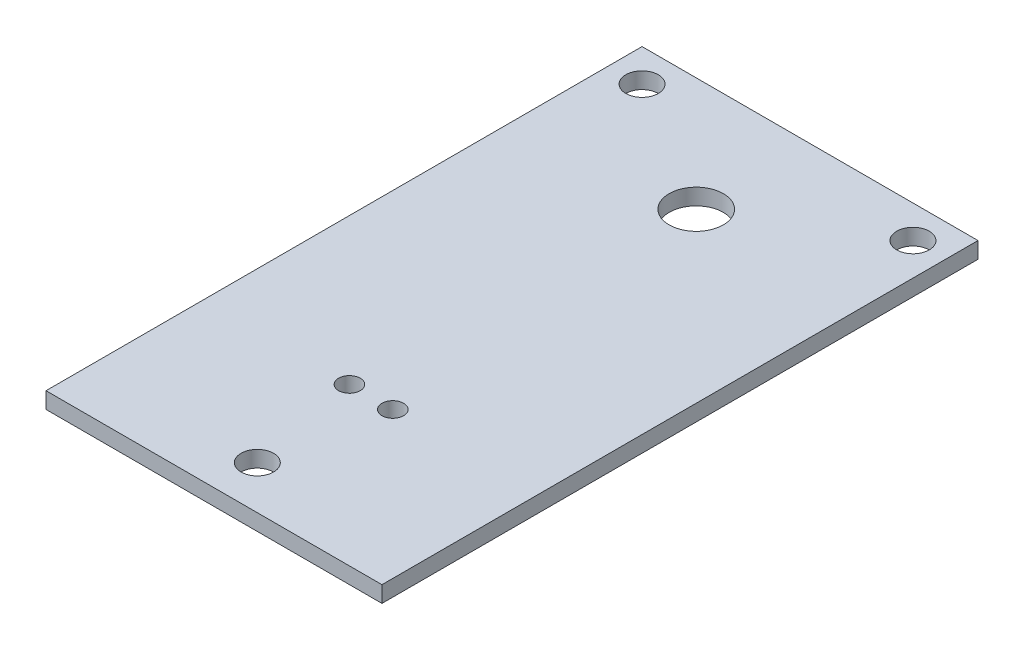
from build123d import *

# Parameters (mm, degrees)
SKETCH1_W      = 62
SKETCH1_H      = 110
SKETCH1_R      = 3
SKETCH1_R_2    = 2
SKETCH1_R_3    = 5
EXTRUDE1_DEPTH = 3


with BuildPart() as part:
    # Sketch1 → Extrude1 (new body)
    with BuildSketch(Plane(origin=(0, 0, 0), x_dir=(1, 0, 0), z_dir=(0, 1, 0))):
        with Locations((31, 55)):
            Rectangle(SKETCH1_W, SKETCH1_H)
        with Locations(Location((6, 104, 0), (0, 0, 270))):
            Circle(SKETCH1_R, mode=Mode.SUBTRACT)
        with Locations(Location((56, 104, 0), (0, 0, 270))):
            Circle(SKETCH1_R, mode=Mode.SUBTRACT)
        with Locations(Location((27, 29, 0), (0, 0, 270))):
            Circle(SKETCH1_R_2, mode=Mode.SUBTRACT)
        with Locations(Location((35, 29, 0), (0, 0, 270))):
            Circle(SKETCH1_R_2, mode=Mode.SUBTRACT)
        with Locations(Location((31, 8, 0), (0, 0, 270))):
            Circle(SKETCH1_R, mode=Mode.SUBTRACT)
        with Locations(Location((31, 89, 0), (0, 0, 270))):
            Circle(SKETCH1_R_3, mode=Mode.SUBTRACT)
    extrude(amount=EXTRUDE1_DEPTH)


solid = part.part
